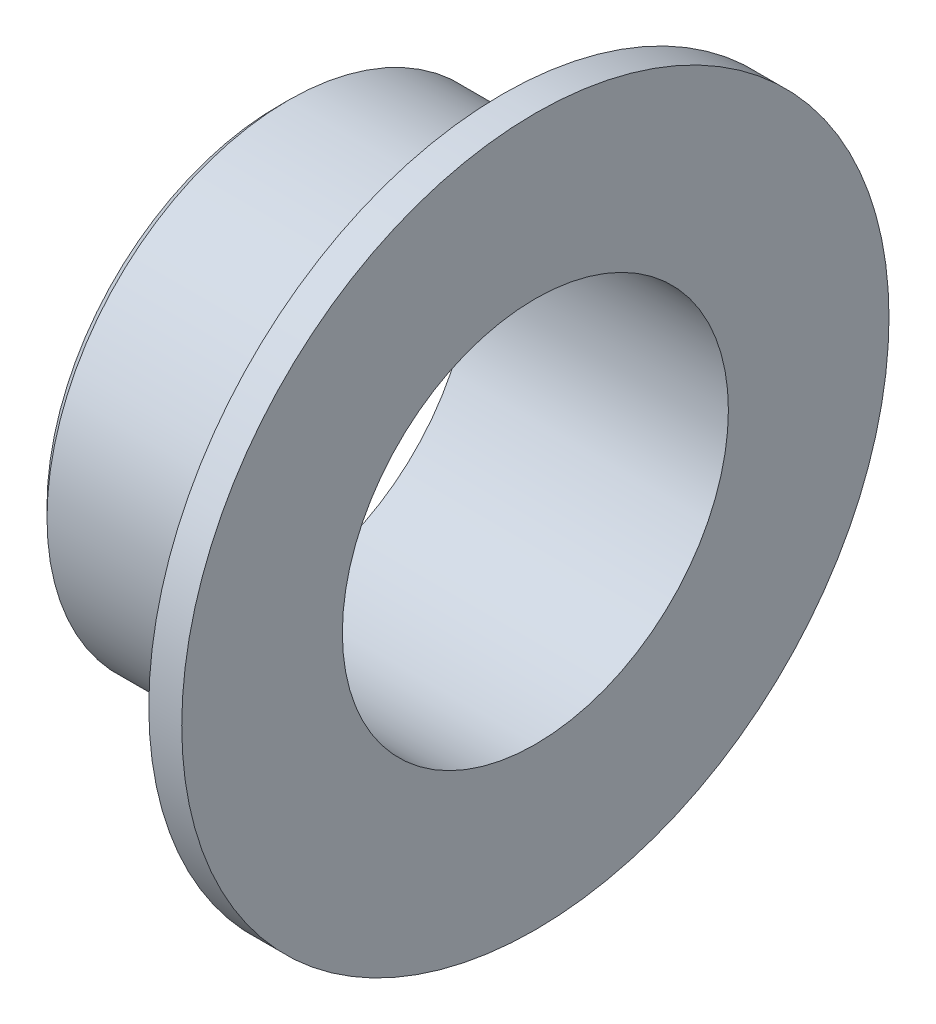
ISO-10303-21;
HEADER;
FILE_DESCRIPTION(('STEP AP214'),'2;1');
FILE_NAME('part.step','',(''),(''),'','','');
FILE_SCHEMA(('AUTOMOTIVE_DESIGN { 1 0 10303 214 1 1 1 1 }'));
ENDSEC;
DATA;
#1=APPLICATION_CONTEXT('core data for automotive mechanical design processes');
#2=APPLICATION_PROTOCOL_DEFINITION('international standard','automotive_design',2000,#1);
#3=PRODUCT_CONTEXT('',#1,'mechanical');
#4=PRODUCT('Part','Part','',(#3));
#5=PRODUCT_RELATED_PRODUCT_CATEGORY('part','',(#4));
#6=PRODUCT_DEFINITION_FORMATION('','',#4);
#7=PRODUCT_DEFINITION_CONTEXT('part definition',#1,'design');
#8=PRODUCT_DEFINITION('design','',#6,#7);
#9=PRODUCT_DEFINITION_SHAPE('','',#8);
#10=(LENGTH_UNIT() NAMED_UNIT(*) SI_UNIT(.MILLI.,.METRE.));
#11=(NAMED_UNIT(*) PLANE_ANGLE_UNIT() SI_UNIT($,.RADIAN.));
#12=(NAMED_UNIT(*) SI_UNIT($,.STERADIAN.) SOLID_ANGLE_UNIT());
#13=UNCERTAINTY_MEASURE_WITH_UNIT(LENGTH_MEASURE(1.E-05),#10,'distance_accuracy_value','');
#14=(GEOMETRIC_REPRESENTATION_CONTEXT(3) GLOBAL_UNCERTAINTY_ASSIGNED_CONTEXT((#13)) GLOBAL_UNIT_ASSIGNED_CONTEXT((#10,
#11,#12)) REPRESENTATION_CONTEXT('',''));
#15=CARTESIAN_POINT('',(0.,0.,0.));
#16=DIRECTION('',(0.,0.,1.));
#17=DIRECTION('',(1.,0.,0.));
#18=AXIS2_PLACEMENT_3D('',#15,#16,#17);
#19=CARTESIAN_POINT('',(0.,-5.953125,0.));
#20=DIRECTION('',(-1.,0.,0.));
#21=DIRECTION('',(0.,0.,1.));
#22=AXIS2_PLACEMENT_3D('',#19,#20,#21);
#23=PLANE('',#22);
#24=CARTESIAN_POINT('',(0.,0.,0.));
#25=DIRECTION('',(-1.,0.,0.));
#26=DIRECTION('',(0.,0.,1.));
#27=AXIS2_PLACEMENT_3D('',#24,#25,#26);
#28=CIRCLE('',#27,5.699125);
#29=CARTESIAN_POINT('',(0.,0.,5.699125));
#30=VERTEX_POINT('',#29);
#31=EDGE_CURVE('E34',#30,#30,#28,.T.);
#32=ORIENTED_EDGE('',*,*,#31,.T.);
#33=EDGE_LOOP('',(#32));
#34=FACE_BOUND('',#33,.T.);
#35=CARTESIAN_POINT('',(0.,0.,0.));
#36=DIRECTION('',(-1.,0.,0.));
#37=DIRECTION('',(0.,0.,1.));
#38=AXIS2_PLACEMENT_3D('',#35,#36,#37);
#39=CIRCLE('',#38,4.7625);
#40=CARTESIAN_POINT('',(0.,0.,4.7625));
#41=VERTEX_POINT('',#40);
#42=EDGE_CURVE('E38',#41,#41,#39,.T.);
#43=ORIENTED_EDGE('',*,*,#42,.F.);
#44=EDGE_LOOP('',(#43));
#45=FACE_BOUND('',#44,.T.);
#46=ADVANCED_FACE('F28',(#34,#45),#23,.T.);
#47=CARTESIAN_POINT('',(0.,0.,0.));
#48=DIRECTION('',(-1.,0.,0.));
#49=DIRECTION('',(0.,0.,1.));
#50=AXIS2_PLACEMENT_3D('',#47,#48,#49);
#51=CYLINDRICAL_SURFACE('',#50,4.7625);
#52=ORIENTED_EDGE('',*,*,#42,.T.);
#53=EDGE_LOOP('',(#52));
#54=FACE_BOUND('',#53,.T.);
#55=CARTESIAN_POINT('',(6.35000000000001,0.,0.));
#56=DIRECTION('',(-1.,0.,0.));
#57=DIRECTION('',(0.,0.,1.));
#58=AXIS2_PLACEMENT_3D('',#55,#56,#57);
#59=CIRCLE('',#58,4.7625);
#60=CARTESIAN_POINT('',(6.35000000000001,0.,4.7625));
#61=VERTEX_POINT('',#60);
#62=EDGE_CURVE('E42',#61,#61,#59,.T.);
#63=ORIENTED_EDGE('',*,*,#62,.F.);
#64=EDGE_LOOP('',(#63));
#65=FACE_BOUND('',#64,.T.);
#66=ADVANCED_FACE('F74',(#54,#65),#51,.F.);
#67=CARTESIAN_POINT('',(6.35000000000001,-4.7625,0.));
#68=DIRECTION('',(1.,0.,0.));
#69=DIRECTION('',(0.,0.,-1.));
#70=AXIS2_PLACEMENT_3D('',#67,#68,#69);
#71=PLANE('',#70);
#72=ORIENTED_EDGE('',*,*,#62,.T.);
#73=EDGE_LOOP('',(#72));
#74=FACE_BOUND('',#73,.T.);
#75=CARTESIAN_POINT('',(6.35000000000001,0.,0.));
#76=DIRECTION('',(-1.,0.,0.));
#77=DIRECTION('',(0.,0.,1.));
#78=AXIS2_PLACEMENT_3D('',#75,#76,#77);
#79=CIRCLE('',#78,8.7249);
#80=CARTESIAN_POINT('',(6.35000000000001,0.,8.7249));
#81=VERTEX_POINT('',#80);
#82=EDGE_CURVE('E47',#81,#81,#79,.T.);
#83=ORIENTED_EDGE('',*,*,#82,.F.);
#84=EDGE_LOOP('',(#83));
#85=FACE_BOUND('',#84,.T.);
#86=ADVANCED_FACE('F70',(#74,#85),#71,.T.);
#87=CARTESIAN_POINT('',(0.,0.,0.));
#88=DIRECTION('',(-1.,0.,0.));
#89=DIRECTION('',(0.,0.,1.));
#90=AXIS2_PLACEMENT_3D('',#87,#88,#89);
#91=CYLINDRICAL_SURFACE('',#90,8.7249);
#92=ORIENTED_EDGE('',*,*,#82,.T.);
#93=EDGE_LOOP('',(#92));
#94=FACE_BOUND('',#93,.T.);
#95=CARTESIAN_POINT('',(5.53720000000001,0.,0.));
#96=DIRECTION('',(-1.,0.,0.));
#97=DIRECTION('',(0.,0.,1.));
#98=AXIS2_PLACEMENT_3D('',#95,#96,#97);
#99=CIRCLE('',#98,8.7249);
#100=CARTESIAN_POINT('',(5.53720000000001,0.,8.7249));
#101=VERTEX_POINT('',#100);
#102=EDGE_CURVE('E50',#101,#101,#99,.T.);
#103=ORIENTED_EDGE('',*,*,#102,.F.);
#104=EDGE_LOOP('',(#103));
#105=FACE_BOUND('',#104,.T.);
#106=ADVANCED_FACE('F61',(#94,#105),#91,.T.);
#107=CARTESIAN_POINT('',(5.53720000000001,-8.7249,0.));
#108=DIRECTION('',(-1.,0.,0.));
#109=DIRECTION('',(0.,0.,1.));
#110=AXIS2_PLACEMENT_3D('',#107,#108,#109);
#111=PLANE('',#110);
#112=ORIENTED_EDGE('',*,*,#102,.T.);
#113=EDGE_LOOP('',(#112));
#114=FACE_BOUND('',#113,.T.);
#115=CARTESIAN_POINT('',(5.53720000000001,0.,0.));
#116=DIRECTION('',(-1.,0.,0.));
#117=DIRECTION('',(0.,0.,1.));
#118=AXIS2_PLACEMENT_3D('',#115,#116,#117);
#119=CIRCLE('',#118,5.953125);
#120=CARTESIAN_POINT('',(5.53720000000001,0.,5.953125));
#121=VERTEX_POINT('',#120);
#122=EDGE_CURVE('E53',#121,#121,#119,.T.);
#123=ORIENTED_EDGE('',*,*,#122,.F.);
#124=EDGE_LOOP('',(#123));
#125=FACE_BOUND('',#124,.T.);
#126=ADVANCED_FACE('F59',(#114,#125),#111,.T.);
#127=CARTESIAN_POINT('',(0.,0.,0.));
#128=DIRECTION('',(-1.,0.,0.));
#129=DIRECTION('',(0.,0.,1.));
#130=AXIS2_PLACEMENT_3D('',#127,#128,#129);
#131=CYLINDRICAL_SURFACE('',#130,5.953125);
#132=CARTESIAN_POINT('',(0.254000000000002,0.,0.));
#133=DIRECTION('',(-1.,0.,0.));
#134=DIRECTION('',(0.,0.,1.));
#135=AXIS2_PLACEMENT_3D('',#132,#133,#134);
#136=CIRCLE('',#135,5.953125);
#137=CARTESIAN_POINT('',(0.254000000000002,0.,5.953125));
#138=VERTEX_POINT('',#137);
#139=EDGE_CURVE('E10',#138,#138,#136,.F.);
#140=ORIENTED_EDGE('',*,*,#139,.T.);
#141=EDGE_LOOP('',(#140));
#142=FACE_BOUND('',#141,.T.);
#143=ORIENTED_EDGE('',*,*,#122,.T.);
#144=EDGE_LOOP('',(#143));
#145=FACE_BOUND('',#144,.T.);
#146=ADVANCED_FACE('F57',(#142,#145),#131,.T.);
#147=CARTESIAN_POINT('',(0.,0.,0.));
#148=DIRECTION('',(1.,0.,0.));
#149=DIRECTION('',(0.,0.,-1.));
#150=AXIS2_PLACEMENT_3D('',#147,#148,#149);
#151=CONICAL_SURFACE('',#150,5.699125,0.785398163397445);
#152=ORIENTED_EDGE('',*,*,#139,.F.);
#153=EDGE_LOOP('',(#152));
#154=FACE_BOUND('',#153,.T.);
#155=ORIENTED_EDGE('',*,*,#31,.F.);
#156=EDGE_LOOP('',(#155));
#157=FACE_BOUND('',#156,.T.);
#158=ADVANCED_FACE('F68',(#154,#157),#151,.T.);
#159=CLOSED_SHELL('',(#46,#66,#86,#106,#126,#146,#158));
#160=MANIFOLD_SOLID_BREP('B2',#159);
#161=ADVANCED_BREP_SHAPE_REPRESENTATION('',(#18,#160),#14);
#162=SHAPE_DEFINITION_REPRESENTATION(#9,#161);
ENDSEC;
END-ISO-10303-21;
